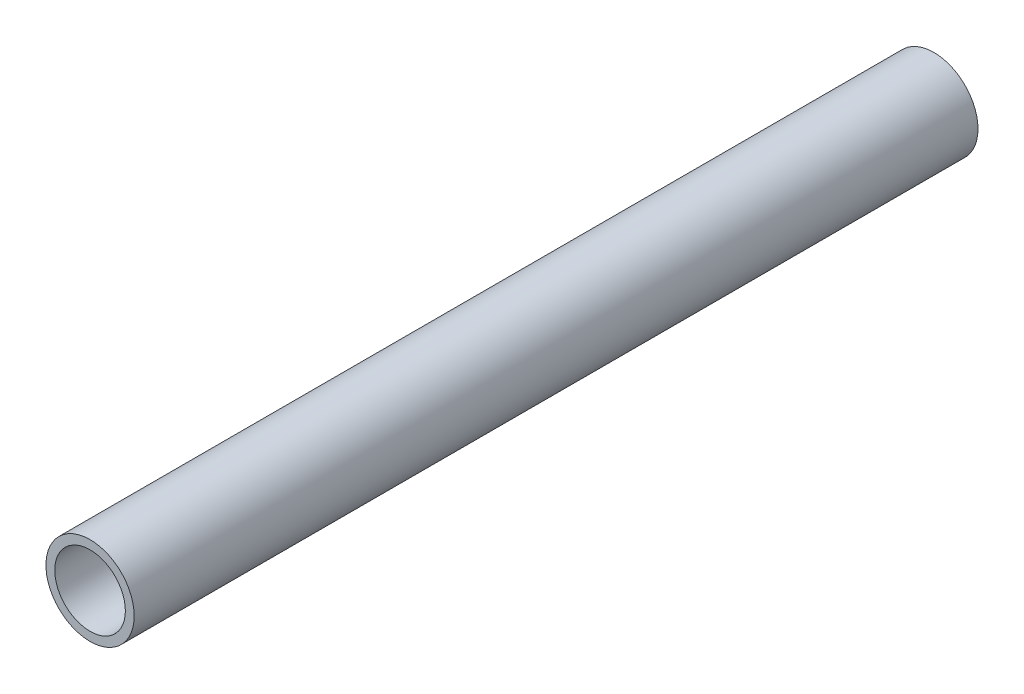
from build123d import *

# Parameters (mm, degrees)
ESQUISSE1_R      = 0.5
ESQUISSE1_R_2    = 0.4
EXTRUSION1_DEPTH = 9.56


with BuildPart() as part:
    # Esquisse1 → Extrusion1 (new body)
    with BuildSketch(Plane.XY):
        Circle(ESQUISSE1_R)
        Circle(ESQUISSE1_R_2, mode=Mode.SUBTRACT)
    extrude(amount=EXTRUSION1_DEPTH)


solid = part.part
